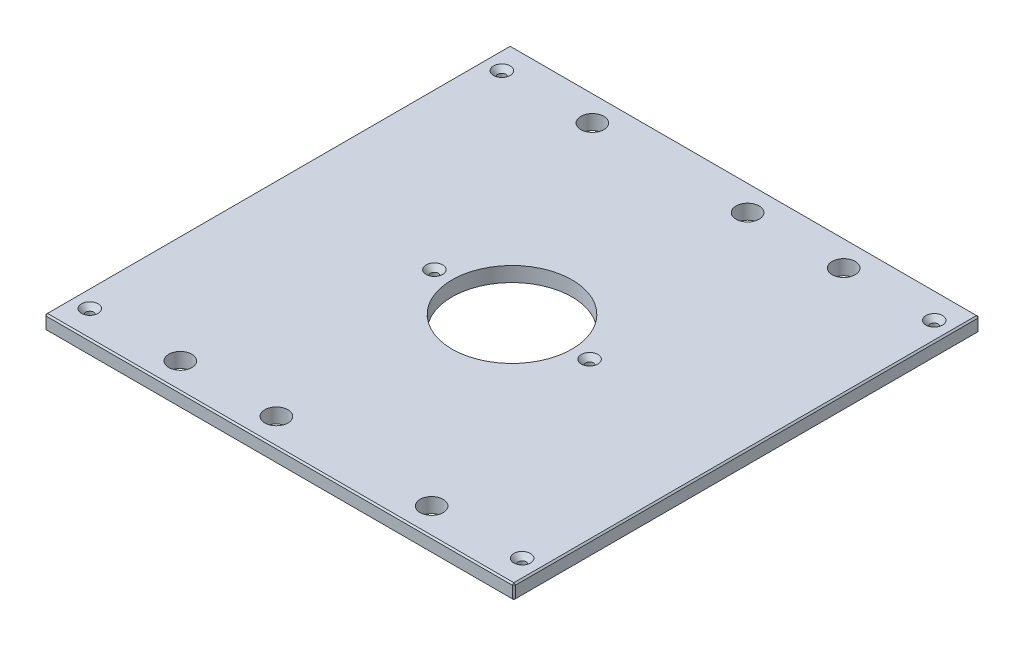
from build123d import *

# Parameters (mm, degrees)
SKETCH1_W                                        = 403.225
SKETCH1_H                                        = 400.05
BOSS_EXTRUDE1_DEPTH                              = 12.7
SKETCH13_R                                       = 51.562
CUT_EXTRUDE6_DEPTH                               = 285.286634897
F_25_32_0_78125_DIAMETER_HOLE1_D                 = 19.84375
CHAMFER2_SIZE                                    = 1.27
CSK_FOR_1_4_FLAT_HEAD_MACHINE_SCREW1_D           = 6.7564
CSK_FOR_1_4_FLAT_HEAD_MACHINE_SCREW1_CSINK_D     = 14.2748
CSK_FOR_1_4_FLAT_HEAD_MACHINE_SCREW1_CSINK_ANGLE = 82


with BuildPart() as part:
    # Sketch1 → Boss-Extrude1 (new body)
    with BuildSketch(Plane(origin=(0, 0, 0), x_dir=(1, 0, 0), z_dir=(0, 1, 0))):
        Rectangle(SKETCH1_W, SKETCH1_H)
    extrude(amount=BOSS_EXTRUDE1_DEPTH)

    # Sketch13 → Cut-Extrude6 (cut, through all)
    with BuildSketch(Plane(origin=(0, 12.7, 0), x_dir=(1, 0, 0), z_dir=(0, 1, 0))):
        with Locations(Location((0, 0, 0), (0, 0, 270))):
            Circle(SKETCH13_R)
    extrude(amount=-CUT_EXTRUDE6_DEPTH, mode=Mode.SUBTRACT)

    # 25_32 _0.78125_ Diameter Hole1 (through all)
    with Locations(Plane(origin=(0, 12.7, 0), x_dir=(1, 0, 0), z_dir=(0, 1, 0))):
        with Locations((107.95, 177.00498), (-107.95, 177.00498), (107.95, -177.00498), (-107.95, -177.00498), (25.4, 177.00498), (-25.4, -177.00498)):
            Hole(F_25_32_0_78125_DIAMETER_HOLE1_D / 2)

    # Chamfer2
    chamfer2_edges = [part.edges().sort_by_distance(p)[0] for p in [
        (201.6125, 12.7, 0),
        (0, 12.7, -200.025),
        (-201.6125, 12.7, 0),
        (0, 0, -200.025),
        (201.6125, 0, 0),
        (0, 0, 200.025),
        (-201.6125, 0, 0),
        (0, 12.7, 200.025),
        (-201.6125, 6.35, -200.025),
        (201.6125, 6.35, -200.025),
        (201.6125, 6.35, 200.025),
        (-201.6125, 6.35, 200.025),
    ]]
    chamfer(chamfer2_edges, length=CHAMFER2_SIZE)

    # CSK for 1_4 Flat Head Machine Screw1 (through all)
    with Locations(Plane(origin=(0, 12.7, 0), x_dir=(1, 0, 0), z_dir=(0, 1, 0))):
        with Locations((185.7375, 177.00498), (185.7375, -177.00498), (-185.7375, -177.00498), (-66.675, 0), (66.675, 0), (-185.7375, 177.00498), (-107.95, 177.00498), (-107.95, -177.00498)):
            CounterSinkHole(CSK_FOR_1_4_FLAT_HEAD_MACHINE_SCREW1_D / 2, CSK_FOR_1_4_FLAT_HEAD_MACHINE_SCREW1_CSINK_D / 2, counter_sink_angle=CSK_FOR_1_4_FLAT_HEAD_MACHINE_SCREW1_CSINK_ANGLE)


solid = part.part
